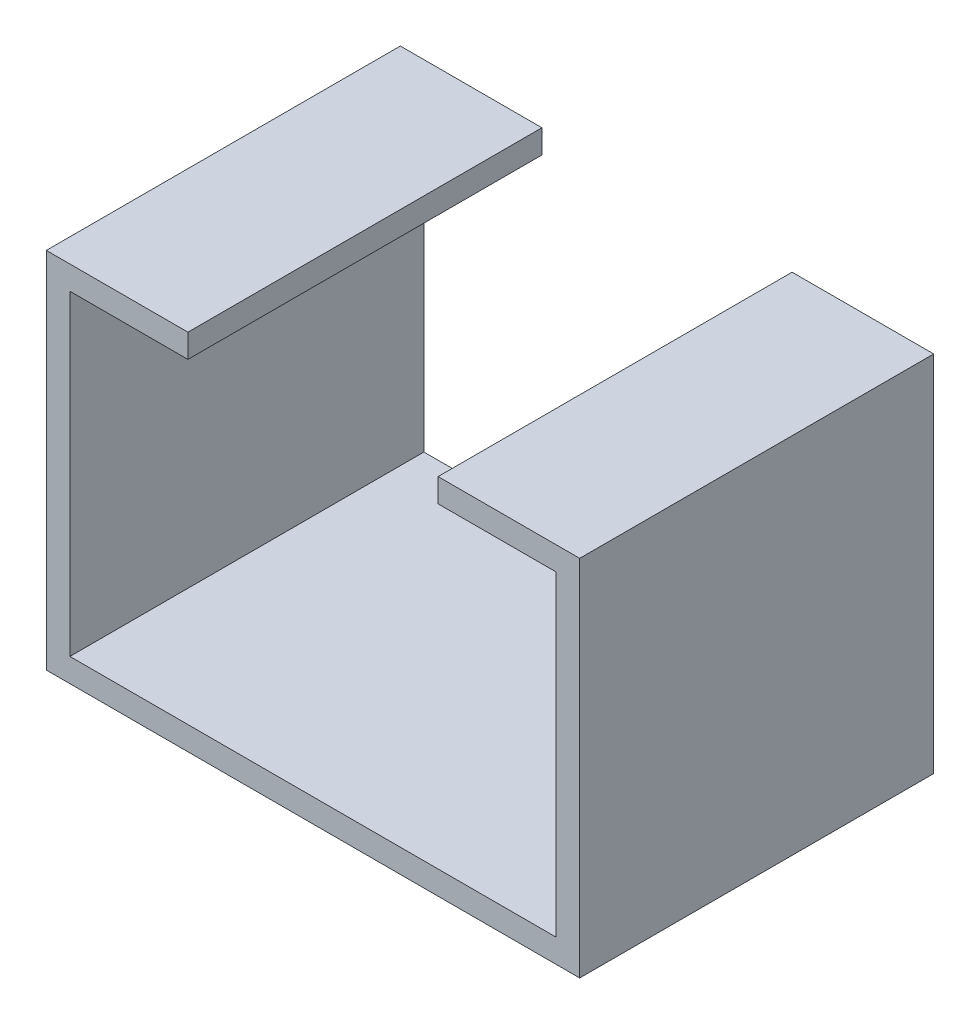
from build123d import *

# Parameters (mm, degrees)
EXTRUDE1_DEPTH = 15


with BuildPart() as part:
    # Sketch1 → Extrude1 (new body)
    with BuildSketch(Plane.XY):
        Polygon((0, 0), (20.6, 0), (20.6, 13.4), (15.6, 13.4), (15.6, 14.4), (21.6, 14.4), (21.6, -1), (-1, -1), (-1, 14.4), (5, 14.4), (5, 13.4), (0, 13.4), align=None)
    extrude(amount=EXTRUDE1_DEPTH)


solid = part.part
